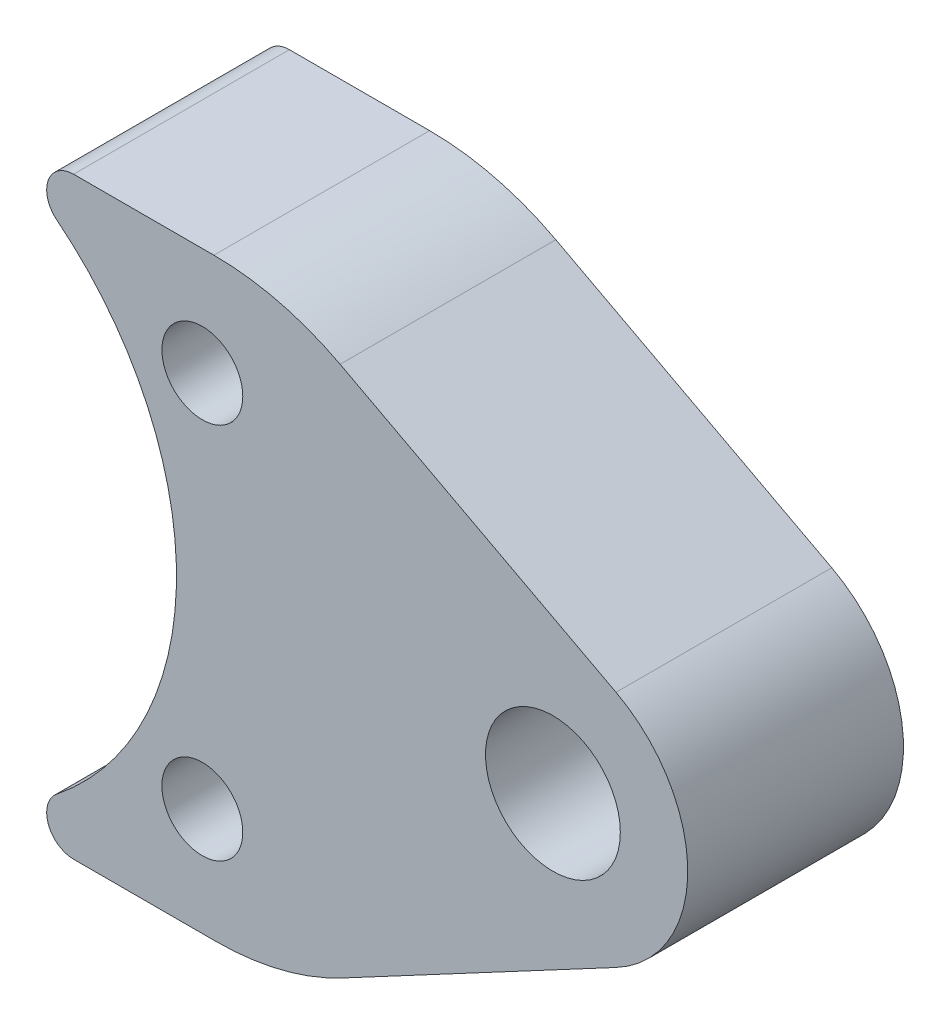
ISO-10303-21;
HEADER;
FILE_DESCRIPTION(('STEP AP214'),'2;1');
FILE_NAME('part.step','',(''),(''),'','','');
FILE_SCHEMA(('AUTOMOTIVE_DESIGN { 1 0 10303 214 1 1 1 1 }'));
ENDSEC;
DATA;
#1=APPLICATION_CONTEXT('core data for automotive mechanical design processes');
#2=APPLICATION_PROTOCOL_DEFINITION('international standard','automotive_design',2000,#1);
#3=PRODUCT_CONTEXT('',#1,'mechanical');
#4=PRODUCT('Part','Part','',(#3));
#5=PRODUCT_RELATED_PRODUCT_CATEGORY('part','',(#4));
#6=PRODUCT_DEFINITION_FORMATION('','',#4);
#7=PRODUCT_DEFINITION_CONTEXT('part definition',#1,'design');
#8=PRODUCT_DEFINITION('design','',#6,#7);
#9=PRODUCT_DEFINITION_SHAPE('','',#8);
#10=(LENGTH_UNIT() NAMED_UNIT(*) SI_UNIT(.MILLI.,.METRE.));
#11=(NAMED_UNIT(*) PLANE_ANGLE_UNIT() SI_UNIT($,.RADIAN.));
#12=(NAMED_UNIT(*) SI_UNIT($,.STERADIAN.) SOLID_ANGLE_UNIT());
#13=UNCERTAINTY_MEASURE_WITH_UNIT(LENGTH_MEASURE(1.E-05),#10,'distance_accuracy_value','');
#14=(GEOMETRIC_REPRESENTATION_CONTEXT(3) GLOBAL_UNCERTAINTY_ASSIGNED_CONTEXT((#13)) GLOBAL_UNIT_ASSIGNED_CONTEXT((#10,
#11,#12)) REPRESENTATION_CONTEXT('',''));
#15=CARTESIAN_POINT('',(0.,0.,0.));
#16=DIRECTION('',(0.,0.,1.));
#17=DIRECTION('',(1.,0.,0.));
#18=AXIS2_PLACEMENT_3D('',#15,#16,#17);
#19=CARTESIAN_POINT('',(12.227935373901,10.,8.));
#20=DIRECTION('',(0.,0.,1.));
#21=DIRECTION('',(1.,0.,0.));
#22=AXIS2_PLACEMENT_3D('',#19,#20,#21);
#23=PLANE('',#22);
#24=CARTESIAN_POINT('',(17.,-7.,8.));
#25=DIRECTION('',(0.,0.,1.));
#26=DIRECTION('',(-1.,0.,0.));
#27=AXIS2_PLACEMENT_3D('',#24,#25,#26);
#28=CIRCLE('',#27,1.5);
#29=CARTESIAN_POINT('',(15.5,-7.,8.));
#30=VERTEX_POINT('',#29);
#31=EDGE_CURVE('E314',#30,#30,#28,.T.);
#32=ORIENTED_EDGE('',*,*,#31,.F.);
#33=EDGE_LOOP('',(#32));
#34=FACE_BOUND('',#33,.T.);
#35=DIRECTION('',(1.,0.,0.));
#36=VECTOR('',#35,1.);
#37=CARTESIAN_POINT('',(20.,-11.,8.));
#38=LINE('',#37,#36);
#39=CARTESIAN_POINT('',(12.227935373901,-11.,8.));
#40=VERTEX_POINT('',#39);
#41=CARTESIAN_POINT('',(17.5,-11.,8.));
#42=VERTEX_POINT('',#41);
#43=EDGE_CURVE('E154',#40,#42,#38,.T.);
#44=ORIENTED_EDGE('',*,*,#43,.T.);
#45=CARTESIAN_POINT('',(17.5,-0.999999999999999,8.));
#46=DIRECTION('',(0.,0.,1.));
#47=DIRECTION('',(1.,0.,0.));
#48=AXIS2_PLACEMENT_3D('',#45,#46,#47);
#49=CIRCLE('',#48,10.);
#50=CARTESIAN_POINT('',(22.2058823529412,-9.82352941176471,8.));
#51=VERTEX_POINT('',#50);
#52=EDGE_CURVE('E185',#42,#51,#49,.T.);
#53=ORIENTED_EDGE('',*,*,#52,.T.);
#54=DIRECTION('',(0.882352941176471,0.470588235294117,0.));
#55=VECTOR('',#54,1.);
#56=CARTESIAN_POINT('',(20.,-11.,8.));
#57=LINE('',#56,#55);
#58=CARTESIAN_POINT('',(32.3529411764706,-4.41176470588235,8.));
#59=VERTEX_POINT('',#58);
#60=EDGE_CURVE('E157',#51,#59,#57,.T.);
#61=ORIENTED_EDGE('',*,*,#60,.T.);
#62=CARTESIAN_POINT('',(30.,0.,8.));
#63=DIRECTION('',(0.,0.,1.));
#64=DIRECTION('',(-1.,0.,0.));
#65=AXIS2_PLACEMENT_3D('',#62,#63,#64);
#66=CIRCLE('',#65,5.);
#67=CARTESIAN_POINT('',(32.3401340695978,4.41857132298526,8.));
#68=VERTEX_POINT('',#67);
#69=EDGE_CURVE('E159',#59,#68,#66,.T.);
#70=ORIENTED_EDGE('',*,*,#69,.T.);
#71=DIRECTION('',(-0.883714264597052,0.468026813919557,0.));
#72=VECTOR('',#71,1.);
#73=CARTESIAN_POINT('',(19.913276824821,11.,8.));
#74=LINE('',#73,#72);
#75=CARTESIAN_POINT('',(22.1089493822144,9.83714264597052,8.));
#76=VERTEX_POINT('',#75);
#77=EDGE_CURVE('E161',#68,#76,#74,.T.);
#78=ORIENTED_EDGE('',*,*,#77,.T.);
#79=CARTESIAN_POINT('',(17.4286812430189,0.999999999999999,8.));
#80=DIRECTION('',(0.,0.,1.));
#81=DIRECTION('',(1.,0.,0.));
#82=AXIS2_PLACEMENT_3D('',#79,#80,#81);
#83=CIRCLE('',#82,10.);
#84=CARTESIAN_POINT('',(17.4286812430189,11.,8.));
#85=VERTEX_POINT('',#84);
#86=EDGE_CURVE('E41',#76,#85,#83,.T.);
#87=ORIENTED_EDGE('',*,*,#86,.T.);
#88=DIRECTION('',(-1.,0.,0.));
#89=VECTOR('',#88,1.);
#90=CARTESIAN_POINT('',(19.913276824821,11.,8.));
#91=LINE('',#90,#89);
#92=CARTESIAN_POINT('',(12.227935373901,11.,8.));
#93=VERTEX_POINT('',#92);
#94=EDGE_CURVE('E163',#85,#93,#91,.T.);
#95=ORIENTED_EDGE('',*,*,#94,.T.);
#96=CARTESIAN_POINT('',(12.227935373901,10.,8.));
#97=DIRECTION('',(0.,0.,1.));
#98=DIRECTION('',(1.,0.,0.));
#99=AXIS2_PLACEMENT_3D('',#96,#97,#98);
#100=CIRCLE('',#99,1.);
#101=CARTESIAN_POINT('',(11.6042926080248,9.21829052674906,8.));
#102=VERTEX_POINT('',#101);
#103=EDGE_CURVE('E149',#93,#102,#100,.T.);
#104=ORIENTED_EDGE('',*,*,#103,.T.);
#105=CARTESIAN_POINT('',(4.24999999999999,0.,8.));
#106=DIRECTION('',(0.,0.,-1.));
#107=DIRECTION('',(-1.,0.,0.));
#108=AXIS2_PLACEMENT_3D('',#105,#106,#107);
#109=CIRCLE('',#108,11.7924764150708);
#110=CARTESIAN_POINT('',(11.6042926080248,-9.21829052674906,8.));
#111=VERTEX_POINT('',#110);
#112=EDGE_CURVE('E120',#102,#111,#109,.T.);
#113=ORIENTED_EDGE('',*,*,#112,.T.);
#114=CARTESIAN_POINT('',(12.227935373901,-10.,8.));
#115=DIRECTION('',(0.,0.,1.));
#116=DIRECTION('',(-1.,0.,0.));
#117=AXIS2_PLACEMENT_3D('',#114,#115,#116);
#118=CIRCLE('',#117,1.);
#119=EDGE_CURVE('E152',#111,#40,#118,.T.);
#120=ORIENTED_EDGE('',*,*,#119,.T.);
#121=EDGE_LOOP('',(#44,#53,#61,#70,#78,#87,#95,#104,#113,#120));
#122=FACE_BOUND('',#121,.T.);
#123=CARTESIAN_POINT('',(17.,7.,8.));
#124=DIRECTION('',(0.,0.,1.));
#125=DIRECTION('',(1.,0.,0.));
#126=AXIS2_PLACEMENT_3D('',#123,#124,#125);
#127=CIRCLE('',#126,1.5);
#128=CARTESIAN_POINT('',(18.5,7.,8.));
#129=VERTEX_POINT('',#128);
#130=EDGE_CURVE('E130',#129,#129,#127,.T.);
#131=ORIENTED_EDGE('',*,*,#130,.F.);
#132=EDGE_LOOP('',(#131));
#133=FACE_BOUND('',#132,.T.);
#134=CARTESIAN_POINT('',(30.,0.,8.));
#135=DIRECTION('',(0.,0.,1.));
#136=DIRECTION('',(1.,0.,0.));
#137=AXIS2_PLACEMENT_3D('',#134,#135,#136);
#138=CIRCLE('',#137,2.50000000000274);
#139=CARTESIAN_POINT('',(32.5000000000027,0.,8.));
#140=VERTEX_POINT('',#139);
#141=EDGE_CURVE('E303',#140,#140,#138,.T.);
#142=ORIENTED_EDGE('',*,*,#141,.F.);
#143=EDGE_LOOP('',(#142));
#144=FACE_BOUND('',#143,.T.);
#145=ADVANCED_FACE('F26',(#34,#122,#133,#144),#23,.T.);
#146=CARTESIAN_POINT('',(12.227935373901,10.,0.));
#147=DIRECTION('',(0.,0.,1.));
#148=DIRECTION('',(1.,0.,0.));
#149=AXIS2_PLACEMENT_3D('',#146,#147,#148);
#150=PLANE('',#149);
#151=CARTESIAN_POINT('',(17.,-7.,0.));
#152=DIRECTION('',(0.,0.,1.));
#153=DIRECTION('',(-1.,0.,0.));
#154=AXIS2_PLACEMENT_3D('',#151,#152,#153);
#155=CIRCLE('',#154,1.5);
#156=CARTESIAN_POINT('',(15.5,-7.,0.));
#157=VERTEX_POINT('',#156);
#158=EDGE_CURVE('E309',#157,#157,#155,.T.);
#159=ORIENTED_EDGE('',*,*,#158,.T.);
#160=EDGE_LOOP('',(#159));
#161=FACE_BOUND('',#160,.T.);
#162=DIRECTION('',(0.882352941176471,0.470588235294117,0.));
#163=VECTOR('',#162,1.);
#164=CARTESIAN_POINT('',(20.,-11.,0.));
#165=LINE('',#164,#163);
#166=CARTESIAN_POINT('',(22.2058823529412,-9.82352941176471,0.));
#167=VERTEX_POINT('',#166);
#168=CARTESIAN_POINT('',(32.3529411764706,-4.41176470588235,0.));
#169=VERTEX_POINT('',#168);
#170=EDGE_CURVE('E141',#167,#169,#165,.T.);
#171=ORIENTED_EDGE('',*,*,#170,.F.);
#172=CARTESIAN_POINT('',(17.5,-0.999999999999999,0.));
#173=DIRECTION('',(0.,0.,1.));
#174=DIRECTION('',(1.,0.,0.));
#175=AXIS2_PLACEMENT_3D('',#172,#173,#174);
#176=CIRCLE('',#175,10.);
#177=CARTESIAN_POINT('',(17.5,-11.,0.));
#178=VERTEX_POINT('',#177);
#179=EDGE_CURVE('E180',#167,#178,#176,.F.);
#180=ORIENTED_EDGE('',*,*,#179,.T.);
#181=DIRECTION('',(1.,0.,0.));
#182=VECTOR('',#181,1.);
#183=CARTESIAN_POINT('',(20.,-11.,0.));
#184=LINE('',#183,#182);
#185=CARTESIAN_POINT('',(12.227935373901,-11.,0.));
#186=VERTEX_POINT('',#185);
#187=EDGE_CURVE('E138',#186,#178,#184,.T.);
#188=ORIENTED_EDGE('',*,*,#187,.F.);
#189=CARTESIAN_POINT('',(12.227935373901,-10.,0.));
#190=DIRECTION('',(0.,0.,1.));
#191=DIRECTION('',(-1.,0.,0.));
#192=AXIS2_PLACEMENT_3D('',#189,#190,#191);
#193=CIRCLE('',#192,1.);
#194=CARTESIAN_POINT('',(11.6042926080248,-9.21829052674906,0.));
#195=VERTEX_POINT('',#194);
#196=EDGE_CURVE('E112',#195,#186,#193,.T.);
#197=ORIENTED_EDGE('',*,*,#196,.F.);
#198=CARTESIAN_POINT('',(4.24999999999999,0.,0.));
#199=DIRECTION('',(0.,0.,-1.));
#200=DIRECTION('',(-1.,0.,0.));
#201=AXIS2_PLACEMENT_3D('',#198,#199,#200);
#202=CIRCLE('',#201,11.7924764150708);
#203=CARTESIAN_POINT('',(11.6042926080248,9.21829052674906,0.));
#204=VERTEX_POINT('',#203);
#205=EDGE_CURVE('E103',#204,#195,#202,.T.);
#206=ORIENTED_EDGE('',*,*,#205,.F.);
#207=CARTESIAN_POINT('',(12.227935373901,10.,0.));
#208=DIRECTION('',(0.,0.,1.));
#209=DIRECTION('',(1.,0.,0.));
#210=AXIS2_PLACEMENT_3D('',#207,#208,#209);
#211=CIRCLE('',#210,1.);
#212=CARTESIAN_POINT('',(12.227935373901,11.,0.));
#213=VERTEX_POINT('',#212);
#214=EDGE_CURVE('E110',#213,#204,#211,.T.);
#215=ORIENTED_EDGE('',*,*,#214,.F.);
#216=DIRECTION('',(-1.,0.,0.));
#217=VECTOR('',#216,1.);
#218=CARTESIAN_POINT('',(19.913276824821,11.,0.));
#219=LINE('',#218,#217);
#220=CARTESIAN_POINT('',(17.4286812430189,11.,0.));
#221=VERTEX_POINT('',#220);
#222=EDGE_CURVE('E147',#221,#213,#219,.T.);
#223=ORIENTED_EDGE('',*,*,#222,.F.);
#224=CARTESIAN_POINT('',(17.4286812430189,0.999999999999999,0.));
#225=DIRECTION('',(0.,0.,1.));
#226=DIRECTION('',(1.,0.,0.));
#227=AXIS2_PLACEMENT_3D('',#224,#225,#226);
#228=CIRCLE('',#227,10.);
#229=CARTESIAN_POINT('',(22.1089493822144,9.83714264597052,0.));
#230=VERTEX_POINT('',#229);
#231=EDGE_CURVE('E178',#221,#230,#228,.F.);
#232=ORIENTED_EDGE('',*,*,#231,.T.);
#233=DIRECTION('',(-0.883714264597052,0.468026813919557,0.));
#234=VECTOR('',#233,1.);
#235=CARTESIAN_POINT('',(19.913276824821,11.,0.));
#236=LINE('',#235,#234);
#237=CARTESIAN_POINT('',(32.3401340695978,4.41857132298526,0.));
#238=VERTEX_POINT('',#237);
#239=EDGE_CURVE('E145',#238,#230,#236,.T.);
#240=ORIENTED_EDGE('',*,*,#239,.F.);
#241=CARTESIAN_POINT('',(30.,0.,0.));
#242=DIRECTION('',(0.,0.,1.));
#243=DIRECTION('',(-1.,0.,0.));
#244=AXIS2_PLACEMENT_3D('',#241,#242,#243);
#245=CIRCLE('',#244,5.);
#246=EDGE_CURVE('E143',#169,#238,#245,.T.);
#247=ORIENTED_EDGE('',*,*,#246,.F.);
#248=EDGE_LOOP('',(#171,#180,#188,#197,#206,#215,#223,#232,#240,#247));
#249=FACE_BOUND('',#248,.T.);
#250=CARTESIAN_POINT('',(17.,7.,0.));
#251=DIRECTION('',(0.,0.,1.));
#252=DIRECTION('',(1.,0.,0.));
#253=AXIS2_PLACEMENT_3D('',#250,#251,#252);
#254=CIRCLE('',#253,1.5);
#255=CARTESIAN_POINT('',(18.5,7.,0.));
#256=VERTEX_POINT('',#255);
#257=EDGE_CURVE('E133',#256,#256,#254,.T.);
#258=ORIENTED_EDGE('',*,*,#257,.T.);
#259=EDGE_LOOP('',(#258));
#260=FACE_BOUND('',#259,.T.);
#261=CARTESIAN_POINT('',(30.,0.,0.));
#262=DIRECTION('',(0.,0.,1.));
#263=DIRECTION('',(1.,0.,0.));
#264=AXIS2_PLACEMENT_3D('',#261,#262,#263);
#265=CIRCLE('',#264,2.50000000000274);
#266=CARTESIAN_POINT('',(32.5000000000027,0.,0.));
#267=VERTEX_POINT('',#266);
#268=EDGE_CURVE('E306',#267,#267,#265,.T.);
#269=ORIENTED_EDGE('',*,*,#268,.T.);
#270=EDGE_LOOP('',(#269));
#271=FACE_BOUND('',#270,.T.);
#272=ADVANCED_FACE('F106',(#161,#249,#260,#271),#150,.F.);
#273=CARTESIAN_POINT('',(12.227935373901,10.,8.));
#274=DIRECTION('',(0.,0.,-1.));
#275=DIRECTION('',(-1.,0.,0.));
#276=AXIS2_PLACEMENT_3D('',#273,#274,#275);
#277=CYLINDRICAL_SURFACE('',#276,1.);
#278=ORIENTED_EDGE('',*,*,#214,.T.);
#279=DIRECTION('',(0.,0.,-1.));
#280=VECTOR('',#279,1.);
#281=CARTESIAN_POINT('',(11.6042926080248,9.21829052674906,8.));
#282=LINE('',#281,#280);
#283=EDGE_CURVE('E118',#102,#204,#282,.T.);
#284=ORIENTED_EDGE('',*,*,#283,.F.);
#285=ORIENTED_EDGE('',*,*,#103,.F.);
#286=DIRECTION('',(0.,0.,-1.));
#287=VECTOR('',#286,1.);
#288=CARTESIAN_POINT('',(12.227935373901,11.,8.));
#289=LINE('',#288,#287);
#290=EDGE_CURVE('E129',#93,#213,#289,.T.);
#291=ORIENTED_EDGE('',*,*,#290,.T.);
#292=EDGE_LOOP('',(#278,#284,#285,#291));
#293=FACE_BOUND('',#292,.T.);
#294=ADVANCED_FACE('F28',(#293),#277,.T.);
#295=CARTESIAN_POINT('',(4.24999999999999,0.,8.));
#296=DIRECTION('',(0.,0.,-1.));
#297=DIRECTION('',(-1.,0.,0.));
#298=AXIS2_PLACEMENT_3D('',#295,#296,#297);
#299=CYLINDRICAL_SURFACE('',#298,11.7924764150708);
#300=ORIENTED_EDGE('',*,*,#205,.T.);
#301=DIRECTION('',(0.,0.,-1.));
#302=VECTOR('',#301,1.);
#303=CARTESIAN_POINT('',(11.6042926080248,-9.21829052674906,8.));
#304=LINE('',#303,#302);
#305=EDGE_CURVE('E125',#111,#195,#304,.T.);
#306=ORIENTED_EDGE('',*,*,#305,.F.);
#307=ORIENTED_EDGE('',*,*,#112,.F.);
#308=ORIENTED_EDGE('',*,*,#283,.T.);
#309=EDGE_LOOP('',(#300,#306,#307,#308));
#310=FACE_BOUND('',#309,.T.);
#311=ADVANCED_FACE('F119',(#310),#299,.F.);
#312=CARTESIAN_POINT('',(12.227935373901,-10.,8.));
#313=DIRECTION('',(0.,0.,-1.));
#314=DIRECTION('',(-1.,0.,0.));
#315=AXIS2_PLACEMENT_3D('',#312,#313,#314);
#316=CYLINDRICAL_SURFACE('',#315,1.);
#317=ORIENTED_EDGE('',*,*,#196,.T.);
#318=DIRECTION('',(0.,0.,-1.));
#319=VECTOR('',#318,1.);
#320=CARTESIAN_POINT('',(12.227935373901,-11.,8.));
#321=LINE('',#320,#319);
#322=EDGE_CURVE('E172',#40,#186,#321,.T.);
#323=ORIENTED_EDGE('',*,*,#322,.F.);
#324=ORIENTED_EDGE('',*,*,#119,.F.);
#325=ORIENTED_EDGE('',*,*,#305,.T.);
#326=EDGE_LOOP('',(#317,#323,#324,#325));
#327=FACE_BOUND('',#326,.T.);
#328=ADVANCED_FACE('F233',(#327),#316,.T.);
#329=CARTESIAN_POINT('',(20.,-11.,8.));
#330=DIRECTION('',(0.,1.,0.));
#331=DIRECTION('',(0.,0.,1.));
#332=AXIS2_PLACEMENT_3D('',#329,#330,#331);
#333=PLANE('',#332);
#334=ORIENTED_EDGE('',*,*,#187,.T.);
#335=DIRECTION('',(0.,0.,-1.));
#336=VECTOR('',#335,1.);
#337=CARTESIAN_POINT('',(17.5,-11.,8.));
#338=LINE('',#337,#336);
#339=EDGE_CURVE('E182',#178,#42,#338,.F.);
#340=ORIENTED_EDGE('',*,*,#339,.T.);
#341=ORIENTED_EDGE('',*,*,#43,.F.);
#342=ORIENTED_EDGE('',*,*,#322,.T.);
#343=EDGE_LOOP('',(#334,#340,#341,#342));
#344=FACE_BOUND('',#343,.T.);
#345=ADVANCED_FACE('F229',(#344),#333,.F.);
#346=CARTESIAN_POINT('',(20.,-11.,8.));
#347=DIRECTION('',(-0.470588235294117,0.882352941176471,0.));
#348=DIRECTION('',(-0.882352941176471,-0.470588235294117,0.));
#349=AXIS2_PLACEMENT_3D('',#346,#347,#348);
#350=PLANE('',#349);
#351=ORIENTED_EDGE('',*,*,#60,.F.);
#352=DIRECTION('',(0.,0.,-1.));
#353=VECTOR('',#352,1.);
#354=CARTESIAN_POINT('',(22.2058823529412,-9.82352941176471,8.));
#355=LINE('',#354,#353);
#356=EDGE_CURVE('E124',#51,#167,#355,.T.);
#357=ORIENTED_EDGE('',*,*,#356,.T.);
#358=ORIENTED_EDGE('',*,*,#170,.T.);
#359=DIRECTION('',(0.,0.,-1.));
#360=VECTOR('',#359,1.);
#361=CARTESIAN_POINT('',(32.3529411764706,-4.41176470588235,8.));
#362=LINE('',#361,#360);
#363=EDGE_CURVE('E169',#59,#169,#362,.T.);
#364=ORIENTED_EDGE('',*,*,#363,.F.);
#365=EDGE_LOOP('',(#351,#357,#358,#364));
#366=FACE_BOUND('',#365,.T.);
#367=ADVANCED_FACE('F225',(#366),#350,.F.);
#368=CARTESIAN_POINT('',(30.,0.,8.));
#369=DIRECTION('',(0.,0.,-1.));
#370=DIRECTION('',(-1.,0.,0.));
#371=AXIS2_PLACEMENT_3D('',#368,#369,#370);
#372=CYLINDRICAL_SURFACE('',#371,5.);
#373=ORIENTED_EDGE('',*,*,#246,.T.);
#374=DIRECTION('',(0.,0.,-1.));
#375=VECTOR('',#374,1.);
#376=CARTESIAN_POINT('',(32.3401340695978,4.41857132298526,8.));
#377=LINE('',#376,#375);
#378=EDGE_CURVE('E166',#68,#238,#377,.T.);
#379=ORIENTED_EDGE('',*,*,#378,.F.);
#380=ORIENTED_EDGE('',*,*,#69,.F.);
#381=ORIENTED_EDGE('',*,*,#363,.T.);
#382=EDGE_LOOP('',(#373,#379,#380,#381));
#383=FACE_BOUND('',#382,.T.);
#384=ADVANCED_FACE('F222',(#383),#372,.T.);
#385=CARTESIAN_POINT('',(19.913276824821,11.,8.));
#386=DIRECTION('',(-0.468026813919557,-0.883714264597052,0.));
#387=DIRECTION('',(0.883714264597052,-0.468026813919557,0.));
#388=AXIS2_PLACEMENT_3D('',#385,#386,#387);
#389=PLANE('',#388);
#390=ORIENTED_EDGE('',*,*,#239,.T.);
#391=DIRECTION('',(0.,0.,-1.));
#392=VECTOR('',#391,1.);
#393=CARTESIAN_POINT('',(22.1089493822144,9.83714264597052,8.));
#394=LINE('',#393,#392);
#395=EDGE_CURVE('E11',#230,#76,#394,.F.);
#396=ORIENTED_EDGE('',*,*,#395,.T.);
#397=ORIENTED_EDGE('',*,*,#77,.F.);
#398=ORIENTED_EDGE('',*,*,#378,.T.);
#399=EDGE_LOOP('',(#390,#396,#397,#398));
#400=FACE_BOUND('',#399,.T.);
#401=ADVANCED_FACE('F193',(#400),#389,.F.);
#402=CARTESIAN_POINT('',(19.913276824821,11.,8.));
#403=DIRECTION('',(0.,-1.,0.));
#404=DIRECTION('',(0.,0.,-1.));
#405=AXIS2_PLACEMENT_3D('',#402,#403,#404);
#406=PLANE('',#405);
#407=ORIENTED_EDGE('',*,*,#94,.F.);
#408=DIRECTION('',(0.,0.,-1.));
#409=VECTOR('',#408,1.);
#410=CARTESIAN_POINT('',(17.4286812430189,11.,8.));
#411=LINE('',#410,#409);
#412=EDGE_CURVE('E34',#85,#221,#411,.T.);
#413=ORIENTED_EDGE('',*,*,#412,.T.);
#414=ORIENTED_EDGE('',*,*,#222,.T.);
#415=ORIENTED_EDGE('',*,*,#290,.F.);
#416=EDGE_LOOP('',(#407,#413,#414,#415));
#417=FACE_BOUND('',#416,.T.);
#418=ADVANCED_FACE('F189',(#417),#406,.F.);
#419=CARTESIAN_POINT('',(17.,7.,8.));
#420=DIRECTION('',(0.,0.,-1.));
#421=DIRECTION('',(-1.,0.,0.));
#422=AXIS2_PLACEMENT_3D('',#419,#420,#421);
#423=CYLINDRICAL_SURFACE('',#422,1.5);
#424=ORIENTED_EDGE('',*,*,#130,.T.);
#425=EDGE_LOOP('',(#424));
#426=FACE_BOUND('',#425,.T.);
#427=ORIENTED_EDGE('',*,*,#257,.F.);
#428=EDGE_LOOP('',(#427));
#429=FACE_BOUND('',#428,.T.);
#430=ADVANCED_FACE('F219',(#426,#429),#423,.F.);
#431=CARTESIAN_POINT('',(17.,-7.,8.));
#432=DIRECTION('',(0.,0.,-1.));
#433=DIRECTION('',(-1.,0.,0.));
#434=AXIS2_PLACEMENT_3D('',#431,#432,#433);
#435=CYLINDRICAL_SURFACE('',#434,1.5);
#436=ORIENTED_EDGE('',*,*,#31,.T.);
#437=EDGE_LOOP('',(#436));
#438=FACE_BOUND('',#437,.T.);
#439=ORIENTED_EDGE('',*,*,#158,.F.);
#440=EDGE_LOOP('',(#439));
#441=FACE_BOUND('',#440,.T.);
#442=ADVANCED_FACE('F279',(#438,#441),#435,.F.);
#443=CARTESIAN_POINT('',(30.,0.,8.));
#444=DIRECTION('',(0.,0.,-1.));
#445=DIRECTION('',(-1.,0.,0.));
#446=AXIS2_PLACEMENT_3D('',#443,#444,#445);
#447=CYLINDRICAL_SURFACE('',#446,2.50000000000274);
#448=ORIENTED_EDGE('',*,*,#141,.T.);
#449=EDGE_LOOP('',(#448));
#450=FACE_BOUND('',#449,.T.);
#451=ORIENTED_EDGE('',*,*,#268,.F.);
#452=EDGE_LOOP('',(#451));
#453=FACE_BOUND('',#452,.T.);
#454=ADVANCED_FACE('F202',(#450,#453),#447,.F.);
#455=CARTESIAN_POINT('',(17.5,-0.999999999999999,8.));
#456=DIRECTION('',(0.,0.,-1.));
#457=DIRECTION('',(-1.,0.,0.));
#458=AXIS2_PLACEMENT_3D('',#455,#456,#457);
#459=CYLINDRICAL_SURFACE('',#458,10.);
#460=ORIENTED_EDGE('',*,*,#52,.F.);
#461=ORIENTED_EDGE('',*,*,#339,.F.);
#462=ORIENTED_EDGE('',*,*,#179,.F.);
#463=ORIENTED_EDGE('',*,*,#356,.F.);
#464=EDGE_LOOP('',(#460,#461,#462,#463));
#465=FACE_BOUND('',#464,.T.);
#466=ADVANCED_FACE('F197',(#465),#459,.T.);
#467=CARTESIAN_POINT('',(17.4286812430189,0.999999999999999,8.));
#468=DIRECTION('',(0.,0.,-1.));
#469=DIRECTION('',(-1.,0.,0.));
#470=AXIS2_PLACEMENT_3D('',#467,#468,#469);
#471=CYLINDRICAL_SURFACE('',#470,10.);
#472=ORIENTED_EDGE('',*,*,#86,.F.);
#473=ORIENTED_EDGE('',*,*,#395,.F.);
#474=ORIENTED_EDGE('',*,*,#231,.F.);
#475=ORIENTED_EDGE('',*,*,#412,.F.);
#476=EDGE_LOOP('',(#472,#473,#474,#475));
#477=FACE_BOUND('',#476,.T.);
#478=ADVANCED_FACE('F195',(#477),#471,.T.);
#479=CLOSED_SHELL('',(#145,#272,#294,#311,#328,#345,#367,#384,#401,#418,#430,#442,#454,#466,#478));
#480=MANIFOLD_SOLID_BREP('B2',#479);
#481=ADVANCED_BREP_SHAPE_REPRESENTATION('',(#18,#480),#14);
#482=SHAPE_DEFINITION_REPRESENTATION(#9,#481);
ENDSEC;
END-ISO-10303-21;
